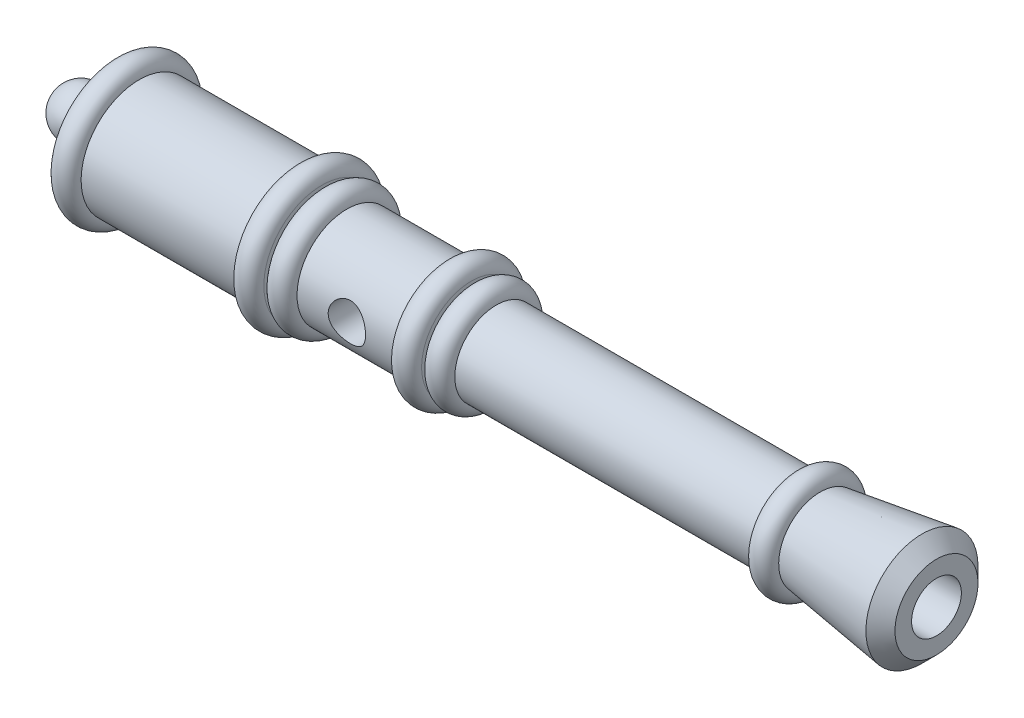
ISO-10303-21;
HEADER;
FILE_DESCRIPTION(('STEP AP214'),'2;1');
FILE_NAME('part.step','',(''),(''),'','','');
FILE_SCHEMA(('AUTOMOTIVE_DESIGN { 1 0 10303 214 1 1 1 1 }'));
ENDSEC;
DATA;
#1=APPLICATION_CONTEXT('core data for automotive mechanical design processes');
#2=APPLICATION_PROTOCOL_DEFINITION('international standard','automotive_design',2000,#1);
#3=PRODUCT_CONTEXT('',#1,'mechanical');
#4=PRODUCT('Part','Part','',(#3));
#5=PRODUCT_RELATED_PRODUCT_CATEGORY('part','',(#4));
#6=PRODUCT_DEFINITION_FORMATION('','',#4);
#7=PRODUCT_DEFINITION_CONTEXT('part definition',#1,'design');
#8=PRODUCT_DEFINITION('design','',#6,#7);
#9=PRODUCT_DEFINITION_SHAPE('','',#8);
#10=(LENGTH_UNIT() NAMED_UNIT(*) SI_UNIT(.MILLI.,.METRE.));
#11=(NAMED_UNIT(*) PLANE_ANGLE_UNIT() SI_UNIT($,.RADIAN.));
#12=(NAMED_UNIT(*) SI_UNIT($,.STERADIAN.) SOLID_ANGLE_UNIT());
#13=UNCERTAINTY_MEASURE_WITH_UNIT(LENGTH_MEASURE(1.E-05),#10,'distance_accuracy_value','');
#14=(GEOMETRIC_REPRESENTATION_CONTEXT(3) GLOBAL_UNCERTAINTY_ASSIGNED_CONTEXT((#13)) GLOBAL_UNIT_ASSIGNED_CONTEXT((#10,
#11,#12)) REPRESENTATION_CONTEXT('',''));
#15=CARTESIAN_POINT('',(0.,0.,0.));
#16=DIRECTION('',(0.,0.,1.));
#17=DIRECTION('',(1.,0.,0.));
#18=AXIS2_PLACEMENT_3D('',#15,#16,#17);
#19=CARTESIAN_POINT('',(2.99999999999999,0.,0.));
#20=DIRECTION('',(-1.,0.,0.));
#21=DIRECTION('',(0.,1.,0.));
#22=AXIS2_PLACEMENT_3D('',#19,#20,#21);
#23=SPHERICAL_SURFACE('',#22,2.99999999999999);
#24=CARTESIAN_POINT('',(3.99999999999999,0.,0.));
#25=DIRECTION('',(-1.,0.,0.));
#26=DIRECTION('',(0.,-1.,0.));
#27=AXIS2_PLACEMENT_3D('',#24,#25,#26);
#28=CIRCLE('',#27,2.82842712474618);
#29=CARTESIAN_POINT('',(3.99999999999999,-2.82842712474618,0.));
#30=VERTEX_POINT('',#29);
#31=EDGE_CURVE('E195',#30,#30,#28,.T.);
#32=ORIENTED_EDGE('',*,*,#31,.T.);
#33=EDGE_LOOP('',(#32));
#34=FACE_BOUND('',#33,.T.);
#35=ADVANCED_FACE('F30',(#34),#23,.T.);
#36=CARTESIAN_POINT('',(96.2679491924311,0.,0.));
#37=DIRECTION('',(1.,0.,0.));
#38=DIRECTION('',(0.,1.,0.));
#39=AXIS2_PLACEMENT_3D('',#36,#37,#38);
#40=CONICAL_SURFACE('',#39,0.,1.04719755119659);
#41=CARTESIAN_POINT('',(98.,0.,0.));
#42=DIRECTION('',(-1.,0.,0.));
#43=DIRECTION('',(0.,-1.,0.));
#44=AXIS2_PLACEMENT_3D('',#41,#42,#43);
#45=CIRCLE('',#44,3.);
#46=CARTESIAN_POINT('',(98.,-3.,0.));
#47=VERTEX_POINT('',#46);
#48=EDGE_CURVE('E166',#47,#47,#45,.T.);
#49=ORIENTED_EDGE('',*,*,#48,.F.);
#50=EDGE_LOOP('',(#49));
#51=FACE_BOUND('',#50,.T.);
#52=CARTESIAN_POINT('',(96.2679491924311,0.,0.));
#53=VERTEX_POINT('',#52);
#54=VERTEX_LOOP('',#53);
#55=FACE_BOUND('',#54,.T.);
#56=ADVANCED_FACE('F45',(#51,#55),#40,.F.);
#57=CARTESIAN_POINT('',(0.,0.,0.));
#58=DIRECTION('',(-1.,0.,0.));
#59=DIRECTION('',(0.,-1.,0.));
#60=AXIS2_PLACEMENT_3D('',#57,#58,#59);
#61=CYLINDRICAL_SURFACE('',#60,3.);
#62=CARTESIAN_POINT('',(106.,0.,0.));
#63=DIRECTION('',(-1.,0.,0.));
#64=DIRECTION('',(0.,-1.,0.));
#65=AXIS2_PLACEMENT_3D('',#62,#63,#64);
#66=CIRCLE('',#65,3.);
#67=CARTESIAN_POINT('',(106.,-3.,0.));
#68=VERTEX_POINT('',#67);
#69=EDGE_CURVE('E163',#68,#68,#66,.T.);
#70=ORIENTED_EDGE('',*,*,#69,.F.);
#71=EDGE_LOOP('',(#70));
#72=FACE_BOUND('',#71,.T.);
#73=ORIENTED_EDGE('',*,*,#48,.T.);
#74=EDGE_LOOP('',(#73));
#75=FACE_BOUND('',#74,.T.);
#76=ADVANCED_FACE('F47',(#72,#75),#61,.F.);
#77=CARTESIAN_POINT('',(106.,3.,0.));
#78=DIRECTION('',(-1.,0.,0.));
#79=DIRECTION('',(0.,-1.,0.));
#80=AXIS2_PLACEMENT_3D('',#77,#78,#79);
#81=PLANE('',#80);
#82=CARTESIAN_POINT('',(106.,0.,0.));
#83=DIRECTION('',(-1.,0.,0.));
#84=DIRECTION('',(0.,-1.,0.));
#85=AXIS2_PLACEMENT_3D('',#82,#83,#84);
#86=CIRCLE('',#85,4.99999999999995);
#87=CARTESIAN_POINT('',(106.,-4.99999999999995,0.));
#88=VERTEX_POINT('',#87);
#89=EDGE_CURVE('E11',#88,#88,#86,.F.);
#90=ORIENTED_EDGE('',*,*,#89,.T.);
#91=EDGE_LOOP('',(#90));
#92=FACE_BOUND('',#91,.T.);
#93=ORIENTED_EDGE('',*,*,#69,.T.);
#94=EDGE_LOOP('',(#93));
#95=FACE_BOUND('',#94,.T.);
#96=ADVANCED_FACE('F53',(#92,#95),#81,.F.);
#97=CARTESIAN_POINT('',(106.,0.,0.));
#98=DIRECTION('',(1.,0.,0.));
#99=DIRECTION('',(0.,1.,0.));
#100=AXIS2_PLACEMENT_3D('',#97,#98,#99);
#101=CONICAL_SURFACE('',#100,7.,0.141897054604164);
#102=CARTESIAN_POINT('',(104.25,0.,0.));
#103=DIRECTION('',(-1.,0.,0.));
#104=DIRECTION('',(0.,-1.,0.));
#105=AXIS2_PLACEMENT_3D('',#102,#103,#104);
#106=CIRCLE('',#105,6.74999999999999);
#107=CARTESIAN_POINT('',(104.25,-6.74999999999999,0.));
#108=VERTEX_POINT('',#107);
#109=EDGE_CURVE('E41',#108,#108,#106,.T.);
#110=ORIENTED_EDGE('',*,*,#109,.T.);
#111=EDGE_LOOP('',(#110));
#112=FACE_BOUND('',#111,.T.);
#113=CARTESIAN_POINT('',(92.,0.,0.));
#114=DIRECTION('',(-1.,0.,0.));
#115=DIRECTION('',(0.,-1.,0.));
#116=AXIS2_PLACEMENT_3D('',#113,#114,#115);
#117=CIRCLE('',#116,5.);
#118=CARTESIAN_POINT('',(92.,-5.,0.));
#119=VERTEX_POINT('',#118);
#120=EDGE_CURVE('E160',#119,#119,#117,.T.);
#121=ORIENTED_EDGE('',*,*,#120,.F.);
#122=EDGE_LOOP('',(#121));
#123=FACE_BOUND('',#122,.T.);
#124=ADVANCED_FACE('F61',(#112,#123),#101,.T.);
#125=CARTESIAN_POINT('',(90.5,0.,0.));
#126=DIRECTION('',(-1.,0.,0.));
#127=DIRECTION('',(0.,-1.,0.));
#128=AXIS2_PLACEMENT_3D('',#125,#126,#127);
#129=TOROIDAL_SURFACE('',#128,5.,1.5);
#130=CARTESIAN_POINT('',(89.,0.,0.));
#131=DIRECTION('',(-1.,0.,0.));
#132=DIRECTION('',(0.,-1.,0.));
#133=AXIS2_PLACEMENT_3D('',#130,#131,#132);
#134=CIRCLE('',#133,5.);
#135=CARTESIAN_POINT('',(89.,-5.,0.));
#136=VERTEX_POINT('',#135);
#137=EDGE_CURVE('E157',#136,#136,#134,.T.);
#138=ORIENTED_EDGE('',*,*,#137,.F.);
#139=EDGE_LOOP('',(#138));
#140=FACE_BOUND('',#139,.T.);
#141=ORIENTED_EDGE('',*,*,#120,.T.);
#142=EDGE_LOOP('',(#141));
#143=FACE_BOUND('',#142,.T.);
#144=ADVANCED_FACE('F65',(#140,#143),#129,.T.);
#145=CARTESIAN_POINT('',(0.,0.,0.));
#146=DIRECTION('',(-1.,0.,0.));
#147=DIRECTION('',(0.,-1.,0.));
#148=AXIS2_PLACEMENT_3D('',#145,#146,#147);
#149=CYLINDRICAL_SURFACE('',#148,5.);
#150=CARTESIAN_POINT('',(53.,0.,0.));
#151=DIRECTION('',(-1.,0.,0.));
#152=DIRECTION('',(0.,-1.,0.));
#153=AXIS2_PLACEMENT_3D('',#150,#151,#152);
#154=CIRCLE('',#153,5.);
#155=CARTESIAN_POINT('',(53.,-5.,0.));
#156=VERTEX_POINT('',#155);
#157=EDGE_CURVE('E154',#156,#156,#154,.T.);
#158=ORIENTED_EDGE('',*,*,#157,.F.);
#159=EDGE_LOOP('',(#158));
#160=FACE_BOUND('',#159,.T.);
#161=ORIENTED_EDGE('',*,*,#137,.T.);
#162=EDGE_LOOP('',(#161));
#163=FACE_BOUND('',#162,.T.);
#164=ADVANCED_FACE('F69',(#160,#163),#149,.T.);
#165=CARTESIAN_POINT('',(51.5,0.,0.));
#166=DIRECTION('',(-1.,0.,0.));
#167=DIRECTION('',(0.,-1.,0.));
#168=AXIS2_PLACEMENT_3D('',#165,#166,#167);
#169=TOROIDAL_SURFACE('',#168,5.,1.5);
#170=CARTESIAN_POINT('',(50.,0.,0.));
#171=DIRECTION('',(-1.,0.,0.));
#172=DIRECTION('',(0.,-1.,0.));
#173=AXIS2_PLACEMENT_3D('',#170,#171,#172);
#174=CIRCLE('',#173,5.);
#175=CARTESIAN_POINT('',(50.,-5.,0.));
#176=VERTEX_POINT('',#175);
#177=EDGE_CURVE('E151',#176,#176,#174,.T.);
#178=ORIENTED_EDGE('',*,*,#177,.F.);
#179=EDGE_LOOP('',(#178));
#180=FACE_BOUND('',#179,.T.);
#181=ORIENTED_EDGE('',*,*,#157,.T.);
#182=EDGE_LOOP('',(#181));
#183=FACE_BOUND('',#182,.T.);
#184=ADVANCED_FACE('F73',(#180,#183),#169,.T.);
#185=CARTESIAN_POINT('',(50.,5.,0.));
#186=DIRECTION('',(-1.,0.,0.));
#187=DIRECTION('',(0.,-1.,0.));
#188=AXIS2_PLACEMENT_3D('',#185,#186,#187);
#189=PLANE('',#188);
#190=CARTESIAN_POINT('',(50.,0.,0.));
#191=DIRECTION('',(-1.,0.,0.));
#192=DIRECTION('',(0.,-1.,0.));
#193=AXIS2_PLACEMENT_3D('',#190,#191,#192);
#194=CIRCLE('',#193,6.);
#195=CARTESIAN_POINT('',(50.,-6.,0.));
#196=VERTEX_POINT('',#195);
#197=EDGE_CURVE('E148',#196,#196,#194,.T.);
#198=ORIENTED_EDGE('',*,*,#197,.F.);
#199=EDGE_LOOP('',(#198));
#200=FACE_BOUND('',#199,.T.);
#201=ORIENTED_EDGE('',*,*,#177,.T.);
#202=EDGE_LOOP('',(#201));
#203=FACE_BOUND('',#202,.T.);
#204=ADVANCED_FACE('F77',(#200,#203),#189,.F.);
#205=CARTESIAN_POINT('',(48.5,0.,0.));
#206=DIRECTION('',(-1.,0.,0.));
#207=DIRECTION('',(0.,-1.,0.));
#208=AXIS2_PLACEMENT_3D('',#205,#206,#207);
#209=TOROIDAL_SURFACE('',#208,6.,1.5);
#210=CARTESIAN_POINT('',(47.,0.,0.));
#211=DIRECTION('',(-1.,0.,0.));
#212=DIRECTION('',(0.,-1.,0.));
#213=AXIS2_PLACEMENT_3D('',#210,#211,#212);
#214=CIRCLE('',#213,6.);
#215=CARTESIAN_POINT('',(47.,-6.,0.));
#216=VERTEX_POINT('',#215);
#217=EDGE_CURVE('E140',#216,#216,#214,.T.);
#218=ORIENTED_EDGE('',*,*,#217,.F.);
#219=EDGE_LOOP('',(#218));
#220=FACE_BOUND('',#219,.T.);
#221=ORIENTED_EDGE('',*,*,#197,.T.);
#222=EDGE_LOOP('',(#221));
#223=FACE_BOUND('',#222,.T.);
#224=ADVANCED_FACE('F81',(#220,#223),#209,.T.);
#225=CARTESIAN_POINT('',(0.,0.,0.));
#226=DIRECTION('',(-1.,0.,0.));
#227=DIRECTION('',(0.,-1.,0.));
#228=AXIS2_PLACEMENT_3D('',#225,#226,#227);
#229=CYLINDRICAL_SURFACE('',#228,6.);
#230=CARTESIAN_POINT('',(43.25,0.,-6.));
#231=CARTESIAN_POINT('',(43.2500043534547,0.121852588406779,-6.00000326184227));
#232=CARTESIAN_POINT('',(43.2400703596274,0.243675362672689,-5.99625568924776));
#233=CARTESIAN_POINT('',(43.2007577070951,0.483680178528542,-5.98168044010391));
#234=CARTESIAN_POINT('',(43.1713818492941,0.601862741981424,-5.9708537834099));
#235=CARTESIAN_POINT('',(43.0943704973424,0.831091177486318,-5.94328248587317));
#236=CARTESIAN_POINT('',(43.0467702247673,0.942150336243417,-5.9265492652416));
#237=CARTESIAN_POINT('',(42.9348403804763,1.15469896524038,-5.8888315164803));
#238=CARTESIAN_POINT('',(42.8705063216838,1.25618585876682,-5.86784584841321));
#239=CARTESIAN_POINT('',(42.7240812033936,1.45101962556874,-5.82279370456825));
#240=CARTESIAN_POINT('',(42.6414046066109,1.54390609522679,-5.79864003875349));
#241=CARTESIAN_POINT('',(42.4618843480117,1.71486632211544,-5.7504033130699));
#242=CARTESIAN_POINT('',(42.3650363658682,1.79293554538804,-5.72632027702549));
#243=CARTESIAN_POINT('',(42.1554237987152,1.93497303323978,-5.67993705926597));
#244=CARTESIAN_POINT('',(42.0421934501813,1.99829089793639,-5.65773973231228));
#245=CARTESIAN_POINT('',(41.8057274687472,2.10477969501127,-5.6189979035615));
#246=CARTESIAN_POINT('',(41.6824958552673,2.14795867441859,-5.60245114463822));
#247=CARTESIAN_POINT('',(41.4348248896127,2.21112646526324,-5.57781619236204));
#248=CARTESIAN_POINT('',(41.3106424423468,2.23199389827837,-5.56940886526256));
#249=CARTESIAN_POINT('',(41.0602757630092,2.25269334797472,-5.56107092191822));
#250=CARTESIAN_POINT('',(40.9340923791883,2.25253405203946,-5.56113680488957));
#251=CARTESIAN_POINT('',(40.6913457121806,2.23185644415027,-5.56946267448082));
#252=CARTESIAN_POINT('',(40.5746586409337,2.21255712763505,-5.57723203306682));
#253=CARTESIAN_POINT('',(40.346319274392,2.15616251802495,-5.59927407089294));
#254=CARTESIAN_POINT('',(40.2346677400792,2.11906454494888,-5.61354772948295));
#255=CARTESIAN_POINT('',(40.0170843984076,2.02745622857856,-5.64728553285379));
#256=CARTESIAN_POINT('',(39.911300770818,1.97262973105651,-5.66684276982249));
#257=CARTESIAN_POINT('',(39.7100813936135,1.84734110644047,-5.70891315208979));
#258=CARTESIAN_POINT('',(39.6146492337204,1.77687358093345,-5.73142731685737));
#259=CARTESIAN_POINT('',(39.4300945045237,1.61672671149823,-5.77872058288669));
#260=CARTESIAN_POINT('',(39.3418270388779,1.52607448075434,-5.80355021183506));
#261=CARTESIAN_POINT('',(39.1814930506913,1.33096888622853,-5.85137592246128));
#262=CARTESIAN_POINT('',(39.1094290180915,1.22651340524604,-5.87437172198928));
#263=CARTESIAN_POINT('',(38.9826044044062,1.00458515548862,-5.9163959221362));
#264=CARTESIAN_POINT('',(38.9281286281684,0.886936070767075,-5.93535747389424));
#265=CARTESIAN_POINT('',(38.8400260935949,0.643255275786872,-5.96668077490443));
#266=CARTESIAN_POINT('',(38.8063900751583,0.517227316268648,-5.9790454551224));
#267=CARTESIAN_POINT('',(38.7625658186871,0.267562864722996,-5.99526664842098));
#268=CARTESIAN_POINT('',(38.7512260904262,0.144155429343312,-5.99954053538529));
#269=CARTESIAN_POINT('',(38.7489634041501,-0.102858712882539,-6.00038840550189));
#270=CARTESIAN_POINT('',(38.7580359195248,-0.226465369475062,-5.99696409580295));
#271=CARTESIAN_POINT('',(38.795465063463,-0.465393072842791,-5.98307564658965));
#272=CARTESIAN_POINT('',(38.8230673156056,-0.580849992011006,-5.97288706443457));
#273=CARTESIAN_POINT('',(38.895779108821,-0.805412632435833,-5.94677215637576));
#274=CARTESIAN_POINT('',(38.940890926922,-0.914517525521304,-5.93084508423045));
#275=CARTESIAN_POINT('',(39.0487796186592,-1.12687164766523,-5.89424436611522));
#276=CARTESIAN_POINT('',(39.1120365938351,-1.22985462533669,-5.87344500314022));
#277=CARTESIAN_POINT('',(39.2538771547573,-1.42408906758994,-5.82940007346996));
#278=CARTESIAN_POINT('',(39.3324663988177,-1.51533618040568,-5.80615360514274));
#279=CARTESIAN_POINT('',(39.5081061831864,-1.68904619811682,-5.75809994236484));
#280=CARTESIAN_POINT('',(39.605963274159,-1.77069231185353,-5.73328044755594));
#281=CARTESIAN_POINT('',(39.8144770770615,-1.91656575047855,-5.6861822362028));
#282=CARTESIAN_POINT('',(39.9251349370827,-1.98079151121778,-5.66390374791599));
#283=CARTESIAN_POINT('',(40.1570239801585,-2.09006660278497,-5.62450244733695));
#284=CARTESIAN_POINT('',(40.2782971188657,-2.13503528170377,-5.6074014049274));
#285=CARTESIAN_POINT('',(40.5275146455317,-2.20361825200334,-5.58081049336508));
#286=CARTESIAN_POINT('',(40.6554548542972,-2.22724575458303,-5.57131591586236));
#287=CARTESIAN_POINT('',(40.9055242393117,-2.25129520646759,-5.5616384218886));
#288=CARTESIAN_POINT('',(41.0274989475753,-2.25310997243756,-5.56089666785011));
#289=CARTESIAN_POINT('',(41.2699179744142,-2.23705073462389,-5.56737619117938));
#290=CARTESIAN_POINT('',(41.3903624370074,-2.21917859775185,-5.57459671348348));
#291=CARTESIAN_POINT('',(41.6225708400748,-2.16533723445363,-5.59572212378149));
#292=CARTESIAN_POINT('',(41.734487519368,-2.12993697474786,-5.60941628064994));
#293=CARTESIAN_POINT('',(41.9508582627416,-2.0425454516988,-5.64182322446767));
#294=CARTESIAN_POINT('',(42.0553104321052,-1.99054999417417,-5.66053727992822));
#295=CARTESIAN_POINT('',(42.2597401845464,-1.86828113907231,-5.70209585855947));
#296=CARTESIAN_POINT('',(42.3591961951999,-1.79719249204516,-5.72510547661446));
#297=CARTESIAN_POINT('',(42.5452123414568,-1.64001728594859,-5.77209370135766));
#298=CARTESIAN_POINT('',(42.6317683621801,-1.55392596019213,-5.79607261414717));
#299=CARTESIAN_POINT('',(42.7943029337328,-1.36362059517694,-5.84385636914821));
#300=CARTESIAN_POINT('',(42.869455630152,-1.25867796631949,-5.86758157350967));
#301=CARTESIAN_POINT('',(43.0010339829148,-1.03681983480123,-5.91081771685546));
#302=CARTESIAN_POINT('',(43.0574581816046,-0.919903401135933,-5.93032832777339));
#303=CARTESIAN_POINT('',(43.1515652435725,-0.671998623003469,-5.9636143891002));
#304=CARTESIAN_POINT('',(43.1883305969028,-0.540620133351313,-5.97710485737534));
#305=CARTESIAN_POINT('',(43.237539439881,-0.272813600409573,-5.9952936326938));
#306=CARTESIAN_POINT('',(43.249995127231,-0.136388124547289,-5.99999634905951));
#307=CARTESIAN_POINT('',(43.25,0.,-6.));
#308=B_SPLINE_CURVE_WITH_KNOTS('',3,(#230,#231,#232,#233,#234,#235,#236,#237,#238,#239,#240,
#241,#242,#243,#244,#245,#246,#247,#248,#249,#250,#251,#252,#253,#254,#255,#256,#257,#258,#259,
#260,#261,#262,#263,#264,#265,#266,#267,#268,#269,#270,#271,#272,#273,#274,#275,#276,#277,#278,
#279,#280,#281,#282,#283,#284,#285,#286,#287,#288,#289,#290,#291,#292,#293,#294,#295,#296,#297,
#298,#299,#300,#301,#302,#303,#304,#305,#306,#307),.UNSPECIFIED.,.T.,.F.,(4,2,2,2,2,2,2,2,2,2,2,
2,2,2,2,2,2,2,2,2,2,2,2,2,2,2,2,2,2,2,2,2,2,2,2,2,2,2,4),(0.,0.365054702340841,
0.730056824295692,1.09435705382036,1.45875506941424,1.83710427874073,2.21556907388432,
2.60845011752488,3.00117404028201,3.37778811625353,3.75424659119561,4.10817517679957,
4.46215707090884,4.82283612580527,5.18363986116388,5.56869230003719,5.953803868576,
6.34487062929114,6.73576349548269,7.10587529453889,7.47590502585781,7.8317165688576,
8.18757439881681,8.553888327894,8.92033770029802,9.30804779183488,9.69579268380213,
10.0851460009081,10.4742581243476,10.8383814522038,11.2024702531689,11.555447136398,
11.9085132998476,12.2800870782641,12.6517791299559,13.0435849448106,13.4354212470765,
13.8442277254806,14.2528290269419),.UNSPECIFIED.);
#309=CARTESIAN_POINT('',(43.25,0.,-6.));
#310=VERTEX_POINT('',#309);
#311=EDGE_CURVE('E33',#310,#310,#308,.T.);
#312=ORIENTED_EDGE('',*,*,#311,.T.);
#313=EDGE_LOOP('',(#312));
#314=FACE_BOUND('',#313,.T.);
#315=CARTESIAN_POINT('',(43.25,0.,6.));
#316=CARTESIAN_POINT('',(43.2500043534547,-0.121852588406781,6.00000326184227));
#317=CARTESIAN_POINT('',(43.2400703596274,-0.24367536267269,5.99625568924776));
#318=CARTESIAN_POINT('',(43.2007577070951,-0.483680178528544,5.98168044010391));
#319=CARTESIAN_POINT('',(43.1713818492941,-0.601862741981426,5.9708537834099));
#320=CARTESIAN_POINT('',(43.0943704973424,-0.83109117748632,5.94328248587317));
#321=CARTESIAN_POINT('',(43.0467702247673,-0.942150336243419,5.9265492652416));
#322=CARTESIAN_POINT('',(42.9348403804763,-1.15469896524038,5.8888315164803));
#323=CARTESIAN_POINT('',(42.8705063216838,-1.25618585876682,5.86784584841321));
#324=CARTESIAN_POINT('',(42.7240812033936,-1.45101962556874,5.82279370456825));
#325=CARTESIAN_POINT('',(42.6414046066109,-1.54390609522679,5.79864003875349));
#326=CARTESIAN_POINT('',(42.4618843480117,-1.71486632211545,5.7504033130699));
#327=CARTESIAN_POINT('',(42.3650363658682,-1.79293554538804,5.72632027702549));
#328=CARTESIAN_POINT('',(42.1554237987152,-1.93497303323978,5.67993705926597));
#329=CARTESIAN_POINT('',(42.0421934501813,-1.9982908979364,5.65773973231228));
#330=CARTESIAN_POINT('',(41.8057274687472,-2.10477969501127,5.6189979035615));
#331=CARTESIAN_POINT('',(41.6824958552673,-2.14795867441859,5.60245114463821));
#332=CARTESIAN_POINT('',(41.4348248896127,-2.21112646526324,5.57781619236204));
#333=CARTESIAN_POINT('',(41.3106424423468,-2.23199389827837,5.56940886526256));
#334=CARTESIAN_POINT('',(41.0602757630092,-2.25269334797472,5.56107092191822));
#335=CARTESIAN_POINT('',(40.9340923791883,-2.25253405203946,5.56113680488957));
#336=CARTESIAN_POINT('',(40.6913457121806,-2.23185644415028,5.56946267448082));
#337=CARTESIAN_POINT('',(40.5746586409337,-2.21255712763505,5.57723203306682));
#338=CARTESIAN_POINT('',(40.346319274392,-2.15616251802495,5.59927407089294));
#339=CARTESIAN_POINT('',(40.2346677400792,-2.11906454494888,5.61354772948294));
#340=CARTESIAN_POINT('',(40.0170843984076,-2.02745622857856,5.64728553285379));
#341=CARTESIAN_POINT('',(39.911300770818,-1.97262973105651,5.66684276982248));
#342=CARTESIAN_POINT('',(39.7100813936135,-1.84734110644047,5.70891315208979));
#343=CARTESIAN_POINT('',(39.6146492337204,-1.77687358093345,5.73142731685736));
#344=CARTESIAN_POINT('',(39.4300945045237,-1.61672671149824,5.77872058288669));
#345=CARTESIAN_POINT('',(39.3418270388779,-1.52607448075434,5.80355021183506));
#346=CARTESIAN_POINT('',(39.1814930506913,-1.33096888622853,5.85137592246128));
#347=CARTESIAN_POINT('',(39.1094290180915,-1.22651340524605,5.87437172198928));
#348=CARTESIAN_POINT('',(38.9826044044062,-1.00458515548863,5.9163959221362));
#349=CARTESIAN_POINT('',(38.9281286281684,-0.886936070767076,5.93535747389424));
#350=CARTESIAN_POINT('',(38.8400260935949,-0.643255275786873,5.96668077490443));
#351=CARTESIAN_POINT('',(38.8063900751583,-0.51722731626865,5.9790454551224));
#352=CARTESIAN_POINT('',(38.7625658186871,-0.267562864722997,5.99526664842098));
#353=CARTESIAN_POINT('',(38.7512260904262,-0.144155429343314,5.99954053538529));
#354=CARTESIAN_POINT('',(38.7489634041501,0.102858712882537,6.00038840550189));
#355=CARTESIAN_POINT('',(38.7580359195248,0.22646536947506,5.99696409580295));
#356=CARTESIAN_POINT('',(38.795465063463,0.465393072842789,5.98307564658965));
#357=CARTESIAN_POINT('',(38.8230673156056,0.580849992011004,5.97288706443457));
#358=CARTESIAN_POINT('',(38.895779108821,0.805412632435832,5.94677215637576));
#359=CARTESIAN_POINT('',(38.940890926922,0.914517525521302,5.93084508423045));
#360=CARTESIAN_POINT('',(39.0487796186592,1.12687164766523,5.89424436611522));
#361=CARTESIAN_POINT('',(39.1120365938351,1.22985462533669,5.87344500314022));
#362=CARTESIAN_POINT('',(39.2538771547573,1.42408906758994,5.82940007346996));
#363=CARTESIAN_POINT('',(39.3324663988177,1.51533618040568,5.80615360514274));
#364=CARTESIAN_POINT('',(39.5081061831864,1.68904619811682,5.75809994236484));
#365=CARTESIAN_POINT('',(39.605963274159,1.77069231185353,5.73328044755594));
#366=CARTESIAN_POINT('',(39.8144770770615,1.91656575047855,5.6861822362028));
#367=CARTESIAN_POINT('',(39.9251349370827,1.98079151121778,5.66390374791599));
#368=CARTESIAN_POINT('',(40.1570239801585,2.09006660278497,5.62450244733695));
#369=CARTESIAN_POINT('',(40.2782971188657,2.13503528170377,5.6074014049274));
#370=CARTESIAN_POINT('',(40.5275146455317,2.20361825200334,5.58081049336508));
#371=CARTESIAN_POINT('',(40.6554548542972,2.22724575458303,5.57131591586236));
#372=CARTESIAN_POINT('',(40.9055242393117,2.25129520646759,5.5616384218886));
#373=CARTESIAN_POINT('',(41.0274989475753,2.25310997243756,5.56089666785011));
#374=CARTESIAN_POINT('',(41.2699179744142,2.23705073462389,5.56737619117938));
#375=CARTESIAN_POINT('',(41.3903624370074,2.21917859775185,5.57459671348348));
#376=CARTESIAN_POINT('',(41.6225708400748,2.16533723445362,5.59572212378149));
#377=CARTESIAN_POINT('',(41.734487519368,2.12993697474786,5.60941628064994));
#378=CARTESIAN_POINT('',(41.9508582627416,2.04254545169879,5.64182322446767));
#379=CARTESIAN_POINT('',(42.0553104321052,1.99054999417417,5.66053727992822));
#380=CARTESIAN_POINT('',(42.2597401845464,1.86828113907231,5.70209585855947));
#381=CARTESIAN_POINT('',(42.3591961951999,1.79719249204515,5.72510547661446));
#382=CARTESIAN_POINT('',(42.5452123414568,1.64001728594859,5.77209370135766));
#383=CARTESIAN_POINT('',(42.6317683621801,1.55392596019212,5.79607261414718));
#384=CARTESIAN_POINT('',(42.7943029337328,1.36362059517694,5.84385636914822));
#385=CARTESIAN_POINT('',(42.869455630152,1.25867796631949,5.86758157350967));
#386=CARTESIAN_POINT('',(43.0010339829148,1.03681983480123,5.91081771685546));
#387=CARTESIAN_POINT('',(43.0574581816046,0.919903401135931,5.93032832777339));
#388=CARTESIAN_POINT('',(43.1515652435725,0.671998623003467,5.9636143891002));
#389=CARTESIAN_POINT('',(43.1883305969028,0.540620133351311,5.97710485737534));
#390=CARTESIAN_POINT('',(43.237539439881,0.272813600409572,5.9952936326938));
#391=CARTESIAN_POINT('',(43.249995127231,0.136388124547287,5.99999634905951));
#392=CARTESIAN_POINT('',(43.25,0.,6.));
#393=B_SPLINE_CURVE_WITH_KNOTS('',3,(#315,#316,#317,#318,#319,#320,#321,#322,#323,#324,#325,
#326,#327,#328,#329,#330,#331,#332,#333,#334,#335,#336,#337,#338,#339,#340,#341,#342,#343,#344,
#345,#346,#347,#348,#349,#350,#351,#352,#353,#354,#355,#356,#357,#358,#359,#360,#361,#362,#363,
#364,#365,#366,#367,#368,#369,#370,#371,#372,#373,#374,#375,#376,#377,#378,#379,#380,#381,#382,
#383,#384,#385,#386,#387,#388,#389,#390,#391,#392),.UNSPECIFIED.,.T.,.F.,(4,2,2,2,2,2,2,2,2,2,2,
2,2,2,2,2,2,2,2,2,2,2,2,2,2,2,2,2,2,2,2,2,2,2,2,2,2,2,4),(0.,0.365054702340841,
0.730056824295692,1.09435705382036,1.45875506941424,1.83710427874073,2.21556907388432,
2.60845011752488,3.00117404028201,3.37778811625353,3.75424659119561,4.10817517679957,
4.46215707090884,4.82283612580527,5.18363986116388,5.56869230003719,5.953803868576,
6.34487062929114,6.73576349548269,7.10587529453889,7.47590502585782,7.8317165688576,
8.18757439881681,8.553888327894,8.92033770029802,9.30804779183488,9.69579268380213,
10.0851460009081,10.4742581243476,10.8383814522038,11.2024702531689,11.555447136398,
11.9085132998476,12.2800870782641,12.6517791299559,13.0435849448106,13.4354212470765,
13.8442277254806,14.2528290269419),.UNSPECIFIED.);
#394=CARTESIAN_POINT('',(43.25,0.,6.));
#395=VERTEX_POINT('',#394);
#396=EDGE_CURVE('E93',#395,#395,#393,.T.);
#397=ORIENTED_EDGE('',*,*,#396,.T.);
#398=EDGE_LOOP('',(#397));
#399=FACE_BOUND('',#398,.T.);
#400=CARTESIAN_POINT('',(35.,0.,0.));
#401=DIRECTION('',(-1.,0.,0.));
#402=DIRECTION('',(0.,-1.,0.));
#403=AXIS2_PLACEMENT_3D('',#400,#401,#402);
#404=CIRCLE('',#403,6.);
#405=CARTESIAN_POINT('',(35.,-6.,0.));
#406=VERTEX_POINT('',#405);
#407=EDGE_CURVE('E137',#406,#406,#404,.T.);
#408=ORIENTED_EDGE('',*,*,#407,.F.);
#409=EDGE_LOOP('',(#408));
#410=FACE_BOUND('',#409,.T.);
#411=ORIENTED_EDGE('',*,*,#217,.T.);
#412=EDGE_LOOP('',(#411));
#413=FACE_BOUND('',#412,.T.);
#414=ADVANCED_FACE('F84',(#314,#399,#410,#413),#229,.T.);
#415=CARTESIAN_POINT('',(33.5,0.,0.));
#416=DIRECTION('',(-1.,0.,0.));
#417=DIRECTION('',(0.,-1.,0.));
#418=AXIS2_PLACEMENT_3D('',#415,#416,#417);
#419=TOROIDAL_SURFACE('',#418,6.,1.5);
#420=CARTESIAN_POINT('',(32.,0.,0.));
#421=DIRECTION('',(-1.,0.,0.));
#422=DIRECTION('',(0.,-1.,0.));
#423=AXIS2_PLACEMENT_3D('',#420,#421,#422);
#424=CIRCLE('',#423,6.);
#425=CARTESIAN_POINT('',(32.,-6.,0.));
#426=VERTEX_POINT('',#425);
#427=EDGE_CURVE('E136',#426,#426,#424,.T.);
#428=ORIENTED_EDGE('',*,*,#427,.F.);
#429=EDGE_LOOP('',(#428));
#430=FACE_BOUND('',#429,.T.);
#431=ORIENTED_EDGE('',*,*,#407,.T.);
#432=EDGE_LOOP('',(#431));
#433=FACE_BOUND('',#432,.T.);
#434=ADVANCED_FACE('F89',(#430,#433),#419,.T.);
#435=CARTESIAN_POINT('',(32.,6.,0.));
#436=DIRECTION('',(-1.,0.,0.));
#437=DIRECTION('',(0.,-1.,0.));
#438=AXIS2_PLACEMENT_3D('',#435,#436,#437);
#439=PLANE('',#438);
#440=CARTESIAN_POINT('',(32.,0.,0.));
#441=DIRECTION('',(-1.,0.,0.));
#442=DIRECTION('',(0.,-1.,0.));
#443=AXIS2_PLACEMENT_3D('',#440,#441,#442);
#444=CIRCLE('',#443,7.);
#445=CARTESIAN_POINT('',(32.,-7.,0.));
#446=VERTEX_POINT('',#445);
#447=EDGE_CURVE('E133',#446,#446,#444,.T.);
#448=ORIENTED_EDGE('',*,*,#447,.F.);
#449=EDGE_LOOP('',(#448));
#450=FACE_BOUND('',#449,.T.);
#451=ORIENTED_EDGE('',*,*,#427,.T.);
#452=EDGE_LOOP('',(#451));
#453=FACE_BOUND('',#452,.T.);
#454=ADVANCED_FACE('F122',(#450,#453),#439,.F.);
#455=CARTESIAN_POINT('',(30.5,0.,0.));
#456=DIRECTION('',(-1.,0.,0.));
#457=DIRECTION('',(0.,-1.,0.));
#458=AXIS2_PLACEMENT_3D('',#455,#456,#457);
#459=TOROIDAL_SURFACE('',#458,7.,1.5);
#460=CARTESIAN_POINT('',(29.,0.,0.));
#461=DIRECTION('',(-1.,0.,0.));
#462=DIRECTION('',(0.,-1.,0.));
#463=AXIS2_PLACEMENT_3D('',#460,#461,#462);
#464=CIRCLE('',#463,7.);
#465=CARTESIAN_POINT('',(29.,-7.,0.));
#466=VERTEX_POINT('',#465);
#467=EDGE_CURVE('E142',#466,#466,#464,.T.);
#468=ORIENTED_EDGE('',*,*,#467,.F.);
#469=EDGE_LOOP('',(#468));
#470=FACE_BOUND('',#469,.T.);
#471=ORIENTED_EDGE('',*,*,#447,.T.);
#472=EDGE_LOOP('',(#471));
#473=FACE_BOUND('',#472,.T.);
#474=ADVANCED_FACE('F119',(#470,#473),#459,.T.);
#475=CARTESIAN_POINT('',(0.,0.,0.));
#476=DIRECTION('',(-1.,0.,0.));
#477=DIRECTION('',(0.,-1.,0.));
#478=AXIS2_PLACEMENT_3D('',#475,#476,#477);
#479=CYLINDRICAL_SURFACE('',#478,7.);
#480=CARTESIAN_POINT('',(9.99999999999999,0.,0.));
#481=DIRECTION('',(-1.,0.,0.));
#482=DIRECTION('',(0.,-1.,0.));
#483=AXIS2_PLACEMENT_3D('',#480,#481,#482);
#484=CIRCLE('',#483,7.);
#485=CARTESIAN_POINT('',(9.99999999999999,-7.,0.));
#486=VERTEX_POINT('',#485);
#487=EDGE_CURVE('E189',#486,#486,#484,.T.);
#488=ORIENTED_EDGE('',*,*,#487,.F.);
#489=EDGE_LOOP('',(#488));
#490=FACE_BOUND('',#489,.T.);
#491=ORIENTED_EDGE('',*,*,#467,.T.);
#492=EDGE_LOOP('',(#491));
#493=FACE_BOUND('',#492,.T.);
#494=ADVANCED_FACE('F115',(#490,#493),#479,.T.);
#495=CARTESIAN_POINT('',(8.49999999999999,0.,0.));
#496=DIRECTION('',(-1.,0.,0.));
#497=DIRECTION('',(0.,-1.,0.));
#498=AXIS2_PLACEMENT_3D('',#495,#496,#497);
#499=TOROIDAL_SURFACE('',#498,7.,1.5);
#500=CARTESIAN_POINT('',(6.99999999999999,0.,0.));
#501=DIRECTION('',(-1.,0.,0.));
#502=DIRECTION('',(0.,-1.,0.));
#503=AXIS2_PLACEMENT_3D('',#500,#501,#502);
#504=CIRCLE('',#503,7.);
#505=CARTESIAN_POINT('',(6.99999999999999,-7.,0.));
#506=VERTEX_POINT('',#505);
#507=EDGE_CURVE('E192',#506,#506,#504,.T.);
#508=ORIENTED_EDGE('',*,*,#507,.F.);
#509=EDGE_LOOP('',(#508));
#510=FACE_BOUND('',#509,.T.);
#511=ORIENTED_EDGE('',*,*,#487,.T.);
#512=EDGE_LOOP('',(#511));
#513=FACE_BOUND('',#512,.T.);
#514=ADVANCED_FACE('F111',(#510,#513),#499,.T.);
#515=CARTESIAN_POINT('',(2.99999999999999,0.,0.));
#516=DIRECTION('',(-1.,0.,0.));
#517=DIRECTION('',(0.,-1.,0.));
#518=AXIS2_PLACEMENT_3D('',#515,#516,#517);
#519=TOROIDAL_SURFACE('',#518,6.71209657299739,4.01034766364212);
#520=ORIENTED_EDGE('',*,*,#31,.F.);
#521=EDGE_LOOP('',(#520));
#522=FACE_BOUND('',#521,.T.);
#523=ORIENTED_EDGE('',*,*,#507,.T.);
#524=EDGE_LOOP('',(#523));
#525=FACE_BOUND('',#524,.T.);
#526=ADVANCED_FACE('F107',(#522,#525),#519,.F.);
#527=CARTESIAN_POINT('',(104.25,0.,0.));
#528=DIRECTION('',(-1.,0.,0.));
#529=DIRECTION('',(0.,-1.,0.));
#530=AXIS2_PLACEMENT_3D('',#527,#528,#529);
#531=CONICAL_SURFACE('',#530,6.75,0.785398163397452);
#532=ORIENTED_EDGE('',*,*,#89,.F.);
#533=EDGE_LOOP('',(#532));
#534=FACE_BOUND('',#533,.T.);
#535=ORIENTED_EDGE('',*,*,#109,.F.);
#536=EDGE_LOOP('',(#535));
#537=FACE_BOUND('',#536,.T.);
#538=ADVANCED_FACE('F102',(#534,#537),#531,.T.);
#539=CARTESIAN_POINT('',(41.,0.,-10.));
#540=DIRECTION('',(0.,0.,1.));
#541=DIRECTION('',(1.,0.,0.));
#542=AXIS2_PLACEMENT_3D('',#539,#540,#541);
#543=CYLINDRICAL_SURFACE('',#542,2.25);
#544=ORIENTED_EDGE('',*,*,#396,.F.);
#545=EDGE_LOOP('',(#544));
#546=FACE_BOUND('',#545,.T.);
#547=ORIENTED_EDGE('',*,*,#311,.F.);
#548=EDGE_LOOP('',(#547));
#549=FACE_BOUND('',#548,.T.);
#550=ADVANCED_FACE('F98',(#546,#549),#543,.F.);
#551=CLOSED_SHELL('',(#35,#56,#76,#96,#124,#144,#164,#184,#204,#224,#414,#434,#454,#474,#494,
#514,#526,#538,#550));
#552=MANIFOLD_SOLID_BREP('B2',#551);
#553=ADVANCED_BREP_SHAPE_REPRESENTATION('',(#18,#552),#14);
#554=SHAPE_DEFINITION_REPRESENTATION(#9,#553);
ENDSEC;
END-ISO-10303-21;
